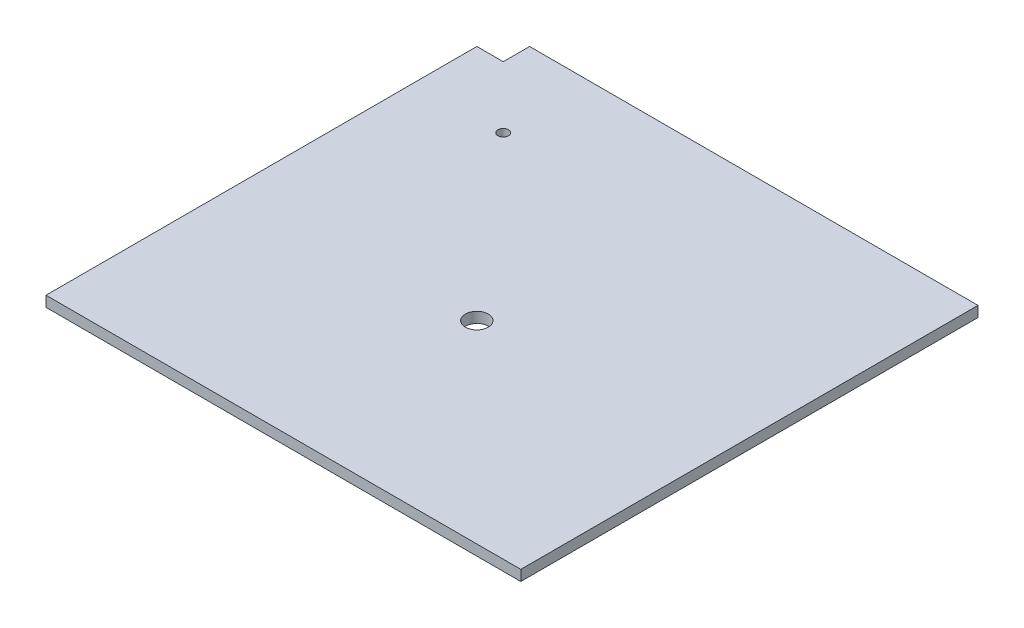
ISO-10303-21;
HEADER;
FILE_DESCRIPTION(('STEP AP214'),'2;1');
FILE_NAME('part.step','',(''),(''),'','','');
FILE_SCHEMA(('AUTOMOTIVE_DESIGN { 1 0 10303 214 1 1 1 1 }'));
ENDSEC;
DATA;
#1=APPLICATION_CONTEXT('core data for automotive mechanical design processes');
#2=APPLICATION_PROTOCOL_DEFINITION('international standard','automotive_design',2000,#1);
#3=PRODUCT_CONTEXT('',#1,'mechanical');
#4=PRODUCT('Part','Part','',(#3));
#5=PRODUCT_RELATED_PRODUCT_CATEGORY('part','',(#4));
#6=PRODUCT_DEFINITION_FORMATION('','',#4);
#7=PRODUCT_DEFINITION_CONTEXT('part definition',#1,'design');
#8=PRODUCT_DEFINITION('design','',#6,#7);
#9=PRODUCT_DEFINITION_SHAPE('','',#8);
#10=(LENGTH_UNIT() NAMED_UNIT(*) SI_UNIT(.MILLI.,.METRE.));
#11=(NAMED_UNIT(*) PLANE_ANGLE_UNIT() SI_UNIT($,.RADIAN.));
#12=(NAMED_UNIT(*) SI_UNIT($,.STERADIAN.) SOLID_ANGLE_UNIT());
#13=UNCERTAINTY_MEASURE_WITH_UNIT(LENGTH_MEASURE(1.E-05),#10,'distance_accuracy_value','');
#14=(GEOMETRIC_REPRESENTATION_CONTEXT(3) GLOBAL_UNCERTAINTY_ASSIGNED_CONTEXT((#13)) GLOBAL_UNIT_ASSIGNED_CONTEXT((#10,
#11,#12)) REPRESENTATION_CONTEXT('',''));
#15=CARTESIAN_POINT('',(0.,0.,0.));
#16=DIRECTION('',(0.,0.,1.));
#17=DIRECTION('',(1.,0.,0.));
#18=AXIS2_PLACEMENT_3D('',#15,#16,#17);
#19=CARTESIAN_POINT('',(135.,6.,130.));
#20=DIRECTION('',(-1.,0.,0.));
#21=DIRECTION('',(0.,0.,1.));
#22=AXIS2_PLACEMENT_3D('',#19,#20,#21);
#23=PLANE('',#22);
#24=DIRECTION('',(0.,0.,-1.));
#25=VECTOR('',#24,1.);
#26=CARTESIAN_POINT('',(135.,0.,130.));
#27=LINE('',#26,#25);
#28=CARTESIAN_POINT('',(135.,0.,130.));
#29=VERTEX_POINT('',#28);
#30=CARTESIAN_POINT('',(135.,0.,-130.));
#31=VERTEX_POINT('',#30);
#32=EDGE_CURVE('E123',#29,#31,#27,.T.);
#33=ORIENTED_EDGE('',*,*,#32,.T.);
#34=DIRECTION('',(0.,-1.,0.));
#35=VECTOR('',#34,1.);
#36=CARTESIAN_POINT('',(135.,6.,-130.));
#37=LINE('',#36,#35);
#38=CARTESIAN_POINT('',(135.,6.,-130.));
#39=VERTEX_POINT('',#38);
#40=EDGE_CURVE('E11',#39,#31,#37,.T.);
#41=ORIENTED_EDGE('',*,*,#40,.F.);
#42=DIRECTION('',(0.,0.,-1.));
#43=VECTOR('',#42,1.);
#44=CARTESIAN_POINT('',(135.,6.,130.));
#45=LINE('',#44,#43);
#46=CARTESIAN_POINT('',(135.,6.,130.));
#47=VERTEX_POINT('',#46);
#48=EDGE_CURVE('E120',#47,#39,#45,.T.);
#49=ORIENTED_EDGE('',*,*,#48,.F.);
#50=DIRECTION('',(0.,-1.,0.));
#51=VECTOR('',#50,1.);
#52=CARTESIAN_POINT('',(135.,6.,130.));
#53=LINE('',#52,#51);
#54=EDGE_CURVE('E127',#47,#29,#53,.T.);
#55=ORIENTED_EDGE('',*,*,#54,.T.);
#56=EDGE_LOOP('',(#33,#41,#49,#55));
#57=FACE_BOUND('',#56,.T.);
#58=ADVANCED_FACE('F36',(#57),#23,.F.);
#59=CARTESIAN_POINT('',(-135.,6.,-130.));
#60=DIRECTION('',(0.,0.,1.));
#61=DIRECTION('',(1.,0.,0.));
#62=AXIS2_PLACEMENT_3D('',#59,#60,#61);
#63=PLANE('',#62);
#64=DIRECTION('',(-1.,0.,0.));
#65=VECTOR('',#64,1.);
#66=CARTESIAN_POINT('',(-135.,0.,-130.));
#67=LINE('',#66,#65);
#68=CARTESIAN_POINT('',(-120.,0.,-130.));
#69=VERTEX_POINT('',#68);
#70=EDGE_CURVE('E118',#31,#69,#67,.T.);
#71=ORIENTED_EDGE('',*,*,#70,.T.);
#72=DIRECTION('',(0.,1.,0.));
#73=VECTOR('',#72,1.);
#74=CARTESIAN_POINT('',(-120.,0.,-130.));
#75=LINE('',#74,#73);
#76=CARTESIAN_POINT('',(-120.,6.,-130.));
#77=VERTEX_POINT('',#76);
#78=EDGE_CURVE('E143',#69,#77,#75,.T.);
#79=ORIENTED_EDGE('',*,*,#78,.T.);
#80=DIRECTION('',(-1.,0.,0.));
#81=VECTOR('',#80,1.);
#82=CARTESIAN_POINT('',(-135.,6.,-130.));
#83=LINE('',#82,#81);
#84=EDGE_CURVE('E82',#39,#77,#83,.T.);
#85=ORIENTED_EDGE('',*,*,#84,.F.);
#86=ORIENTED_EDGE('',*,*,#40,.T.);
#87=EDGE_LOOP('',(#71,#79,#85,#86));
#88=FACE_BOUND('',#87,.T.);
#89=ADVANCED_FACE('F151',(#88),#63,.F.);
#90=CARTESIAN_POINT('',(-135.,6.,130.));
#91=DIRECTION('',(1.,0.,0.));
#92=DIRECTION('',(0.,0.,-1.));
#93=AXIS2_PLACEMENT_3D('',#90,#91,#92);
#94=PLANE('',#93);
#95=DIRECTION('',(0.,0.,1.));
#96=VECTOR('',#95,1.);
#97=CARTESIAN_POINT('',(-135.,6.,130.));
#98=LINE('',#97,#96);
#99=CARTESIAN_POINT('',(-135.,6.,-115.));
#100=VERTEX_POINT('',#99);
#101=CARTESIAN_POINT('',(-135.,6.,130.));
#102=VERTEX_POINT('',#101);
#103=EDGE_CURVE('E113',#100,#102,#98,.T.);
#104=ORIENTED_EDGE('',*,*,#103,.F.);
#105=DIRECTION('',(0.,1.,0.));
#106=VECTOR('',#105,1.);
#107=CARTESIAN_POINT('',(-135.,0.,-115.));
#108=LINE('',#107,#106);
#109=CARTESIAN_POINT('',(-135.,0.,-115.));
#110=VERTEX_POINT('',#109);
#111=EDGE_CURVE('E101',#110,#100,#108,.T.);
#112=ORIENTED_EDGE('',*,*,#111,.F.);
#113=DIRECTION('',(0.,0.,1.));
#114=VECTOR('',#113,1.);
#115=CARTESIAN_POINT('',(-135.,0.,130.));
#116=LINE('',#115,#114);
#117=CARTESIAN_POINT('',(-135.,0.,130.));
#118=VERTEX_POINT('',#117);
#119=EDGE_CURVE('E112',#110,#118,#116,.T.);
#120=ORIENTED_EDGE('',*,*,#119,.T.);
#121=DIRECTION('',(0.,-1.,0.));
#122=VECTOR('',#121,1.);
#123=CARTESIAN_POINT('',(-135.,6.,130.));
#124=LINE('',#123,#122);
#125=EDGE_CURVE('E43',#102,#118,#124,.T.);
#126=ORIENTED_EDGE('',*,*,#125,.F.);
#127=EDGE_LOOP('',(#104,#112,#120,#126));
#128=FACE_BOUND('',#127,.T.);
#129=ADVANCED_FACE('F110',(#128),#94,.F.);
#130=CARTESIAN_POINT('',(-135.,6.,130.));
#131=DIRECTION('',(0.,0.,-1.));
#132=DIRECTION('',(-1.,0.,0.));
#133=AXIS2_PLACEMENT_3D('',#130,#131,#132);
#134=PLANE('',#133);
#135=DIRECTION('',(1.,0.,0.));
#136=VECTOR('',#135,1.);
#137=CARTESIAN_POINT('',(-135.,0.,130.));
#138=LINE('',#137,#136);
#139=EDGE_CURVE('E76',#118,#29,#138,.T.);
#140=ORIENTED_EDGE('',*,*,#139,.T.);
#141=ORIENTED_EDGE('',*,*,#54,.F.);
#142=DIRECTION('',(1.,0.,0.));
#143=VECTOR('',#142,1.);
#144=CARTESIAN_POINT('',(-135.,6.,130.));
#145=LINE('',#144,#143);
#146=EDGE_CURVE('E59',#102,#47,#145,.T.);
#147=ORIENTED_EDGE('',*,*,#146,.F.);
#148=ORIENTED_EDGE('',*,*,#125,.T.);
#149=EDGE_LOOP('',(#140,#141,#147,#148));
#150=FACE_BOUND('',#149,.T.);
#151=ADVANCED_FACE('F128',(#150),#134,.F.);
#152=CARTESIAN_POINT('',(0.,6.,0.));
#153=DIRECTION('',(0.,-1.,0.));
#154=DIRECTION('',(0.,0.,-1.));
#155=AXIS2_PLACEMENT_3D('',#152,#153,#154);
#156=PLANE('',#155);
#157=CARTESIAN_POINT('',(-85.,6.,-80.));
#158=DIRECTION('',(0.,1.,0.));
#159=DIRECTION('',(0.,0.,1.));
#160=AXIS2_PLACEMENT_3D('',#157,#158,#159);
#161=CIRCLE('',#160,3.00000000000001);
#162=CARTESIAN_POINT('',(-85.,6.,-77.));
#163=VERTEX_POINT('',#162);
#164=EDGE_CURVE('E146',#163,#163,#161,.T.);
#165=ORIENTED_EDGE('',*,*,#164,.F.);
#166=EDGE_LOOP('',(#165));
#167=FACE_BOUND('',#166,.T.);
#168=CARTESIAN_POINT('',(0.,6.,20.));
#169=DIRECTION('',(0.,1.,0.));
#170=DIRECTION('',(0.,0.,1.));
#171=AXIS2_PLACEMENT_3D('',#168,#169,#170);
#172=CIRCLE('',#171,6.5);
#173=CARTESIAN_POINT('',(0.,6.,26.5));
#174=VERTEX_POINT('',#173);
#175=EDGE_CURVE('E134',#174,#174,#172,.T.);
#176=ORIENTED_EDGE('',*,*,#175,.F.);
#177=EDGE_LOOP('',(#176));
#178=FACE_BOUND('',#177,.T.);
#179=ORIENTED_EDGE('',*,*,#84,.T.);
#180=DIRECTION('',(0.,0.,-1.));
#181=VECTOR('',#180,1.);
#182=CARTESIAN_POINT('',(-120.,6.,-130.));
#183=LINE('',#182,#181);
#184=CARTESIAN_POINT('',(-120.,6.,-115.));
#185=VERTEX_POINT('',#184);
#186=EDGE_CURVE('E106',#185,#77,#183,.T.);
#187=ORIENTED_EDGE('',*,*,#186,.F.);
#188=DIRECTION('',(1.,0.,0.));
#189=VECTOR('',#188,1.);
#190=CARTESIAN_POINT('',(-135.,6.,-115.));
#191=LINE('',#190,#189);
#192=EDGE_CURVE('E154',#100,#185,#191,.T.);
#193=ORIENTED_EDGE('',*,*,#192,.F.);
#194=ORIENTED_EDGE('',*,*,#103,.T.);
#195=ORIENTED_EDGE('',*,*,#146,.T.);
#196=ORIENTED_EDGE('',*,*,#48,.T.);
#197=EDGE_LOOP('',(#179,#187,#193,#194,#195,#196));
#198=FACE_BOUND('',#197,.T.);
#199=ADVANCED_FACE('F150',(#167,#178,#198),#156,.F.);
#200=CARTESIAN_POINT('',(0.,0.,0.));
#201=DIRECTION('',(0.,-1.,0.));
#202=DIRECTION('',(0.,0.,-1.));
#203=AXIS2_PLACEMENT_3D('',#200,#201,#202);
#204=PLANE('',#203);
#205=DIRECTION('',(0.,0.,-1.));
#206=VECTOR('',#205,1.);
#207=CARTESIAN_POINT('',(-120.,0.,-130.));
#208=LINE('',#207,#206);
#209=CARTESIAN_POINT('',(-120.,0.,-115.));
#210=VERTEX_POINT('',#209);
#211=EDGE_CURVE('E50',#210,#69,#208,.T.);
#212=ORIENTED_EDGE('',*,*,#211,.T.);
#213=ORIENTED_EDGE('',*,*,#70,.F.);
#214=ORIENTED_EDGE('',*,*,#32,.F.);
#215=ORIENTED_EDGE('',*,*,#139,.F.);
#216=ORIENTED_EDGE('',*,*,#119,.F.);
#217=DIRECTION('',(1.,0.,0.));
#218=VECTOR('',#217,1.);
#219=CARTESIAN_POINT('',(-135.,0.,-115.));
#220=LINE('',#219,#218);
#221=EDGE_CURVE('E97',#110,#210,#220,.T.);
#222=ORIENTED_EDGE('',*,*,#221,.T.);
#223=EDGE_LOOP('',(#212,#213,#214,#215,#216,#222));
#224=FACE_BOUND('',#223,.T.);
#225=CARTESIAN_POINT('',(-85.,0.,-80.));
#226=DIRECTION('',(0.,1.,0.));
#227=DIRECTION('',(0.,0.,1.));
#228=AXIS2_PLACEMENT_3D('',#225,#226,#227);
#229=CIRCLE('',#228,3.00000000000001);
#230=CARTESIAN_POINT('',(-85.,0.,-77.));
#231=VERTEX_POINT('',#230);
#232=EDGE_CURVE('E156',#231,#231,#229,.T.);
#233=ORIENTED_EDGE('',*,*,#232,.T.);
#234=EDGE_LOOP('',(#233));
#235=FACE_BOUND('',#234,.T.);
#236=CARTESIAN_POINT('',(0.,0.,20.));
#237=DIRECTION('',(0.,-1.,0.));
#238=DIRECTION('',(0.,0.,-1.));
#239=AXIS2_PLACEMENT_3D('',#236,#237,#238);
#240=CIRCLE('',#239,6.5);
#241=CARTESIAN_POINT('',(0.,0.,26.5));
#242=VERTEX_POINT('',#241);
#243=EDGE_CURVE('E138',#242,#242,#240,.F.);
#244=ORIENTED_EDGE('',*,*,#243,.T.);
#245=EDGE_LOOP('',(#244));
#246=FACE_BOUND('',#245,.T.);
#247=ADVANCED_FACE('F115',(#224,#235,#246),#204,.T.);
#248=CARTESIAN_POINT('',(0.,-0.00100000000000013,20.));
#249=DIRECTION('',(0.,1.,0.));
#250=DIRECTION('',(0.,0.,1.));
#251=AXIS2_PLACEMENT_3D('',#248,#249,#250);
#252=CYLINDRICAL_SURFACE('',#251,6.5);
#253=CARTESIAN_POINT('',(0.,0.,26.5));
#254=CARTESIAN_POINT('',(0.,0.0624999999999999,26.5));
#255=CARTESIAN_POINT('',(0.,0.125,26.5));
#256=CARTESIAN_POINT('',(0.,0.25,26.5));
#257=CARTESIAN_POINT('',(0.,0.3125,26.5));
#258=CARTESIAN_POINT('',(0.,0.4375,26.5));
#259=CARTESIAN_POINT('',(0.,0.5,26.5));
#260=CARTESIAN_POINT('',(0.,0.625,26.5));
#261=CARTESIAN_POINT('',(0.,0.6875,26.5));
#262=CARTESIAN_POINT('',(0.,0.8125,26.5));
#263=CARTESIAN_POINT('',(0.,0.875,26.5));
#264=CARTESIAN_POINT('',(0.,1.,26.5));
#265=CARTESIAN_POINT('',(0.,1.0625,26.5));
#266=CARTESIAN_POINT('',(0.,1.1875,26.5));
#267=CARTESIAN_POINT('',(0.,1.25,26.5));
#268=CARTESIAN_POINT('',(0.,1.375,26.5));
#269=CARTESIAN_POINT('',(0.,1.4375,26.5));
#270=CARTESIAN_POINT('',(0.,1.5625,26.5));
#271=CARTESIAN_POINT('',(0.,1.625,26.5));
#272=CARTESIAN_POINT('',(0.,1.75,26.5));
#273=CARTESIAN_POINT('',(0.,1.8125,26.5));
#274=CARTESIAN_POINT('',(0.,1.9375,26.5));
#275=CARTESIAN_POINT('',(0.,2.,26.5));
#276=CARTESIAN_POINT('',(0.,2.125,26.5));
#277=CARTESIAN_POINT('',(0.,2.1875,26.5));
#278=CARTESIAN_POINT('',(0.,2.3125,26.5));
#279=CARTESIAN_POINT('',(0.,2.375,26.5));
#280=CARTESIAN_POINT('',(0.,2.5,26.5));
#281=CARTESIAN_POINT('',(0.,2.5625,26.5));
#282=CARTESIAN_POINT('',(0.,2.6875,26.5));
#283=CARTESIAN_POINT('',(0.,2.75,26.5));
#284=CARTESIAN_POINT('',(0.,2.875,26.5));
#285=CARTESIAN_POINT('',(0.,2.9375,26.5));
#286=CARTESIAN_POINT('',(0.,3.0625,26.5));
#287=CARTESIAN_POINT('',(0.,3.125,26.5));
#288=CARTESIAN_POINT('',(0.,3.25,26.5));
#289=CARTESIAN_POINT('',(0.,3.3125,26.5));
#290=CARTESIAN_POINT('',(0.,3.4375,26.5));
#291=CARTESIAN_POINT('',(0.,3.5,26.5));
#292=CARTESIAN_POINT('',(0.,3.625,26.5));
#293=CARTESIAN_POINT('',(0.,3.6875,26.5));
#294=CARTESIAN_POINT('',(0.,3.8125,26.5));
#295=CARTESIAN_POINT('',(0.,3.875,26.5));
#296=CARTESIAN_POINT('',(0.,4.,26.5));
#297=CARTESIAN_POINT('',(0.,4.0625,26.5));
#298=CARTESIAN_POINT('',(0.,4.1875,26.5));
#299=CARTESIAN_POINT('',(0.,4.25,26.5));
#300=CARTESIAN_POINT('',(0.,4.375,26.5));
#301=CARTESIAN_POINT('',(0.,4.4375,26.5));
#302=CARTESIAN_POINT('',(0.,4.5625,26.5));
#303=CARTESIAN_POINT('',(0.,4.625,26.5));
#304=CARTESIAN_POINT('',(0.,4.75,26.5));
#305=CARTESIAN_POINT('',(0.,4.8125,26.5));
#306=CARTESIAN_POINT('',(0.,4.9375,26.5));
#307=CARTESIAN_POINT('',(0.,5.,26.5));
#308=CARTESIAN_POINT('',(0.,5.125,26.5));
#309=CARTESIAN_POINT('',(0.,5.1875,26.5));
#310=CARTESIAN_POINT('',(0.,5.3125,26.5));
#311=CARTESIAN_POINT('',(0.,5.375,26.5));
#312=CARTESIAN_POINT('',(0.,5.5,26.5));
#313=CARTESIAN_POINT('',(0.,5.5625,26.5));
#314=CARTESIAN_POINT('',(0.,5.6875,26.5));
#315=CARTESIAN_POINT('',(0.,5.75,26.5));
#316=CARTESIAN_POINT('',(0.,5.875,26.5));
#317=CARTESIAN_POINT('',(0.,5.9375,26.5));
#318=CARTESIAN_POINT('',(0.,6.,26.5));
#319=B_SPLINE_CURVE_WITH_KNOTS('',3,(#253,#254,#255,#256,#257,#258,#259,#260,#261,#262,#263,
#264,#265,#266,#267,#268,#269,#270,#271,#272,#273,#274,#275,#276,#277,#278,#279,#280,#281,#282,
#283,#284,#285,#286,#287,#288,#289,#290,#291,#292,#293,#294,#295,#296,#297,#298,#299,#300,#301,
#302,#303,#304,#305,#306,#307,#308,#309,#310,#311,#312,#313,#314,#315,#316,#317,#318),
.UNSPECIFIED.,.F.,.F.,(4,2,2,2,2,2,2,2,2,2,2,2,2,2,2,2,2,2,2,2,2,2,2,2,2,2,2,2,2,2,2,2,4),(0.,
0.1875,0.375,0.5625,0.75,0.9375,1.125,1.3125,1.5,1.6875,1.875,2.0625,2.25,2.4375,2.625,2.8125,
3.,3.1875,3.375,3.5625,3.75,3.9375,4.125,4.3125,4.5,4.6875,4.875,5.0625,5.25,5.4375,5.625,
5.8125,6.),.UNSPECIFIED.);
#320=EDGE_CURVE('BSEAM173',#242,#174,#319,.T.);
#321=ORIENTED_EDGE('',*,*,#243,.F.);
#322=ORIENTED_EDGE('',*,*,#175,.T.);
#323=ORIENTED_EDGE('',*,*,#320,.T.);
#324=ORIENTED_EDGE('',*,*,#320,.F.);
#325=EDGE_LOOP('',(#321,#323,#322,#324));
#326=FACE_BOUND('',#325,.T.);
#327=ADVANCED_FACE('F173',(#326),#252,.F.);
#328=CARTESIAN_POINT('',(-85.,0.,-80.));
#329=DIRECTION('',(0.,1.,0.));
#330=DIRECTION('',(0.,0.,1.));
#331=AXIS2_PLACEMENT_3D('',#328,#329,#330);
#332=CYLINDRICAL_SURFACE('',#331,3.00000000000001);
#333=ORIENTED_EDGE('',*,*,#232,.F.);
#334=EDGE_LOOP('',(#333));
#335=FACE_BOUND('',#334,.T.);
#336=ORIENTED_EDGE('',*,*,#164,.T.);
#337=EDGE_LOOP('',(#336));
#338=FACE_BOUND('',#337,.T.);
#339=ADVANCED_FACE('F164',(#335,#338),#332,.F.);
#340=CARTESIAN_POINT('',(-120.,0.,-130.));
#341=DIRECTION('',(1.,0.,0.));
#342=DIRECTION('',(0.,0.,-1.));
#343=AXIS2_PLACEMENT_3D('',#340,#341,#342);
#344=PLANE('',#343);
#345=ORIENTED_EDGE('',*,*,#186,.T.);
#346=ORIENTED_EDGE('',*,*,#78,.F.);
#347=ORIENTED_EDGE('',*,*,#211,.F.);
#348=DIRECTION('',(0.,1.,0.));
#349=VECTOR('',#348,1.);
#350=CARTESIAN_POINT('',(-120.,0.,-115.));
#351=LINE('',#350,#349);
#352=EDGE_CURVE('E103',#210,#185,#351,.T.);
#353=ORIENTED_EDGE('',*,*,#352,.T.);
#354=EDGE_LOOP('',(#345,#346,#347,#353));
#355=FACE_BOUND('',#354,.T.);
#356=ADVANCED_FACE('F217',(#355),#344,.F.);
#357=CARTESIAN_POINT('',(-135.,0.,-115.));
#358=DIRECTION('',(0.,0.,1.));
#359=DIRECTION('',(1.,0.,0.));
#360=AXIS2_PLACEMENT_3D('',#357,#358,#359);
#361=PLANE('',#360);
#362=ORIENTED_EDGE('',*,*,#192,.T.);
#363=ORIENTED_EDGE('',*,*,#352,.F.);
#364=ORIENTED_EDGE('',*,*,#221,.F.);
#365=ORIENTED_EDGE('',*,*,#111,.T.);
#366=EDGE_LOOP('',(#362,#363,#364,#365));
#367=FACE_BOUND('',#366,.T.);
#368=ADVANCED_FACE('F100',(#367),#361,.F.);
#369=CLOSED_SHELL('',(#58,#89,#129,#151,#199,#247,#327,#339,#356,#368));
#370=MANIFOLD_SOLID_BREP('B2',#369);
#371=ADVANCED_BREP_SHAPE_REPRESENTATION('',(#18,#370),#14);
#372=SHAPE_DEFINITION_REPRESENTATION(#9,#371);
ENDSEC;
END-ISO-10303-21;
